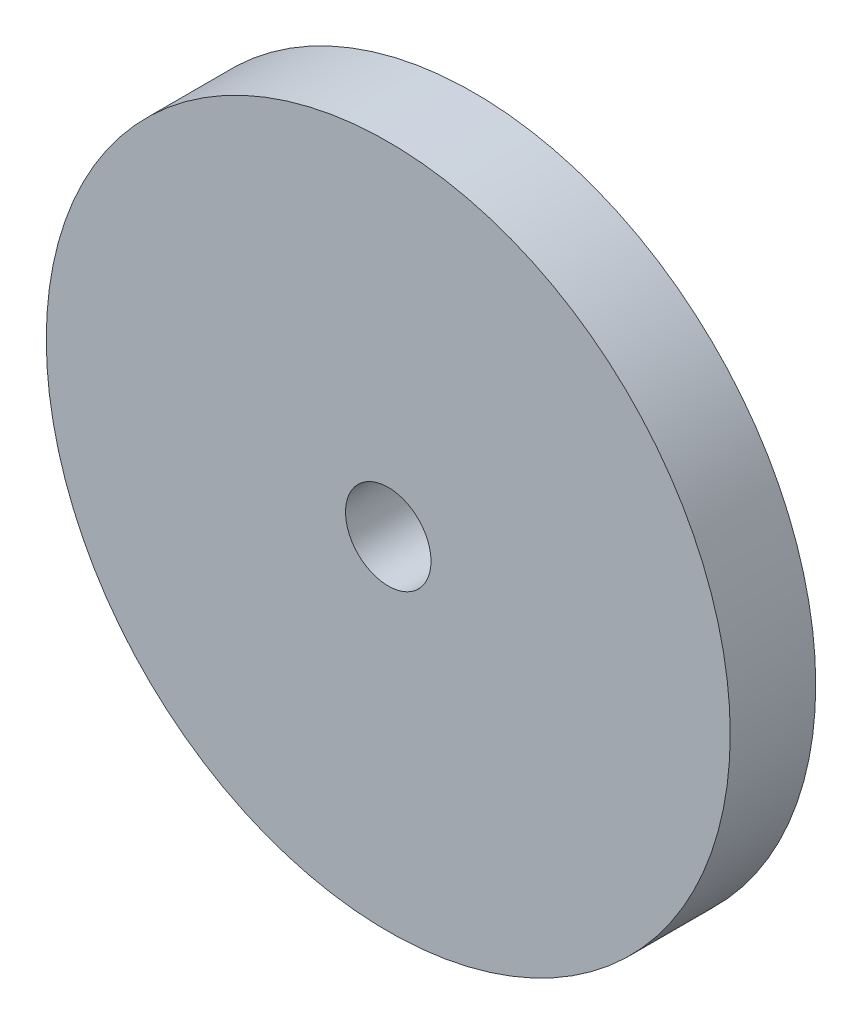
from build123d import *

# Parameters (mm, degrees)
SKETCH1_R           = 12.7
SKETCH1_R_2         = 1.5875
BOSS_EXTRUDE1_DEPTH = 3.175


with BuildPart() as part:
    # Sketch1 → Boss-Extrude1 (new body)
    with BuildSketch(Plane.XY):
        Circle(SKETCH1_R)
        Circle(SKETCH1_R_2, mode=Mode.SUBTRACT)
    extrude(amount=BOSS_EXTRUDE1_DEPTH)


solid = part.part
